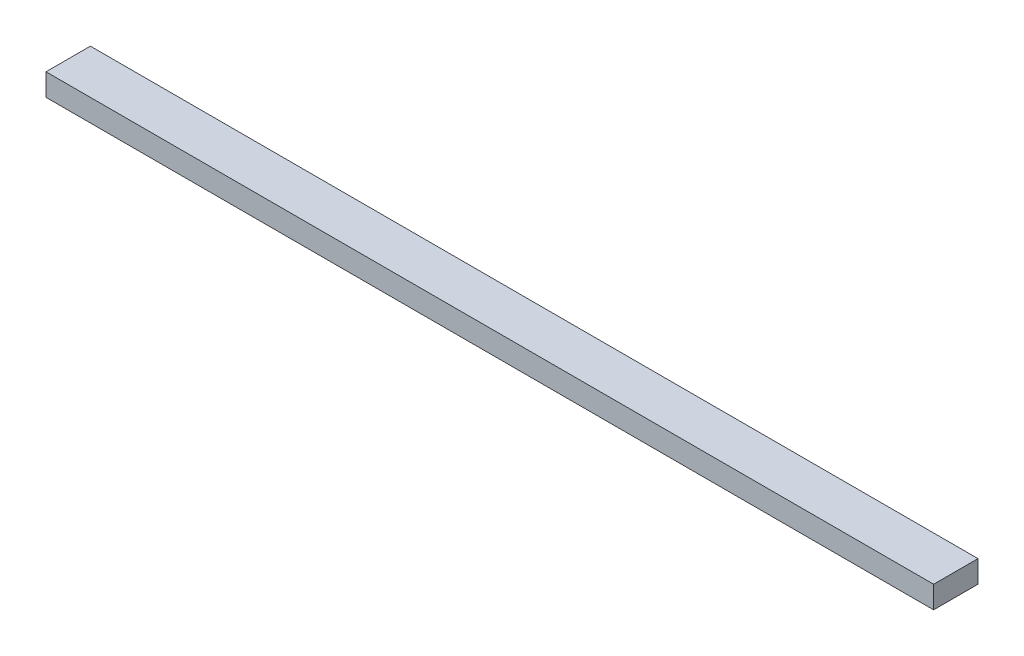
from build123d import *

# Parameters (mm, degrees)
SKETCH1_W           = 20000
SKETCH1_H           = 1000
BOSS_EXTRUDE1_DEPTH = 500


with BuildPart() as part:
    # Sketch1 → Boss-Extrude1 (new body)
    with BuildSketch(Plane(origin=(0, 0, 0), x_dir=(1, 0, 0), z_dir=(0, 1, 0))):
        Rectangle(SKETCH1_W, SKETCH1_H)
    extrude(amount=BOSS_EXTRUDE1_DEPTH)


solid = part.part
